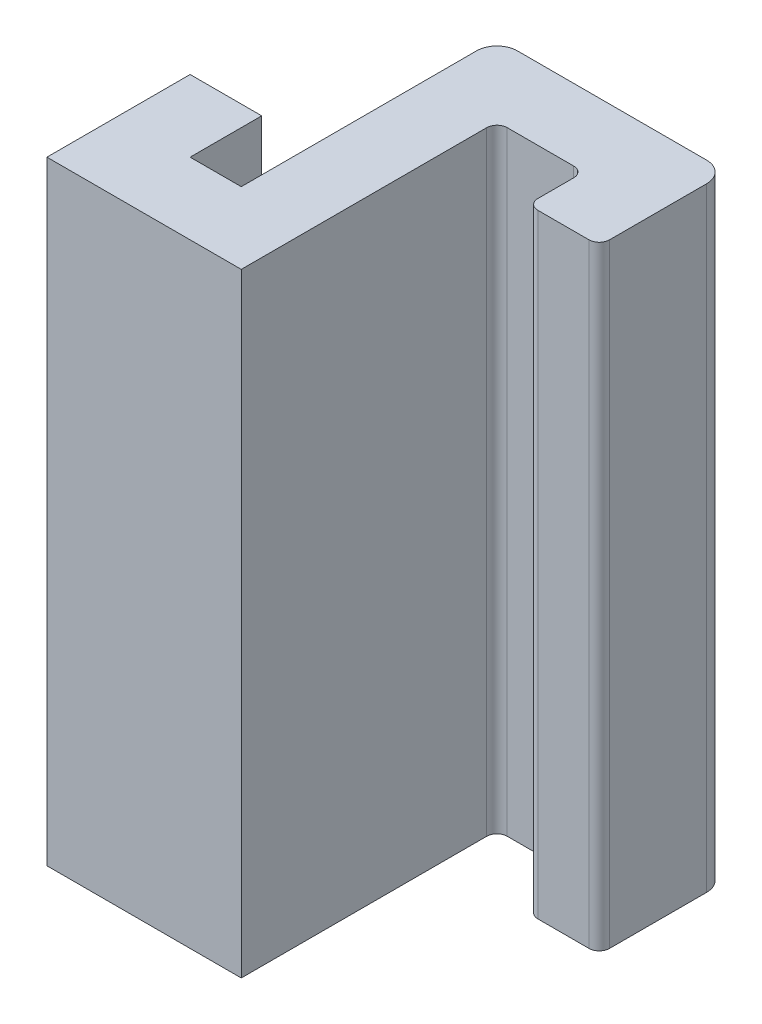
ISO-10303-21;
HEADER;
FILE_DESCRIPTION(('STEP AP214'),'2;1');
FILE_NAME('part.step','',(''),(''),'','','');
FILE_SCHEMA(('AUTOMOTIVE_DESIGN { 1 0 10303 214 1 1 1 1 }'));
ENDSEC;
DATA;
#1=APPLICATION_CONTEXT('core data for automotive mechanical design processes');
#2=APPLICATION_PROTOCOL_DEFINITION('international standard','automotive_design',2000,#1);
#3=PRODUCT_CONTEXT('',#1,'mechanical');
#4=PRODUCT('Part','Part','',(#3));
#5=PRODUCT_RELATED_PRODUCT_CATEGORY('part','',(#4));
#6=PRODUCT_DEFINITION_FORMATION('','',#4);
#7=PRODUCT_DEFINITION_CONTEXT('part definition',#1,'design');
#8=PRODUCT_DEFINITION('design','',#6,#7);
#9=PRODUCT_DEFINITION_SHAPE('','',#8);
#10=(LENGTH_UNIT() NAMED_UNIT(*) SI_UNIT(.MILLI.,.METRE.));
#11=(NAMED_UNIT(*) PLANE_ANGLE_UNIT() SI_UNIT($,.RADIAN.));
#12=(NAMED_UNIT(*) SI_UNIT($,.STERADIAN.) SOLID_ANGLE_UNIT());
#13=UNCERTAINTY_MEASURE_WITH_UNIT(LENGTH_MEASURE(1.E-05),#10,'distance_accuracy_value','');
#14=(GEOMETRIC_REPRESENTATION_CONTEXT(3) GLOBAL_UNCERTAINTY_ASSIGNED_CONTEXT((#13)) GLOBAL_UNIT_ASSIGNED_CONTEXT((#10,
#11,#12)) REPRESENTATION_CONTEXT('',''));
#15=CARTESIAN_POINT('',(0.,0.,0.));
#16=DIRECTION('',(0.,0.,1.));
#17=DIRECTION('',(1.,0.,0.));
#18=AXIS2_PLACEMENT_3D('',#15,#16,#17);
#19=CARTESIAN_POINT('',(0.,60.,0.));
#20=DIRECTION('',(-1.,0.,0.));
#21=DIRECTION('',(0.,0.,1.));
#22=AXIS2_PLACEMENT_3D('',#19,#20,#21);
#23=PLANE('',#22);
#24=DIRECTION('',(0.,0.,-1.));
#25=VECTOR('',#24,1.);
#26=CARTESIAN_POINT('',(0.,0.,0.));
#27=LINE('',#26,#25);
#28=CARTESIAN_POINT('',(0.,0.,0.));
#29=VERTEX_POINT('',#28);
#30=CARTESIAN_POINT('',(0.,0.,-24.));
#31=VERTEX_POINT('',#30);
#32=EDGE_CURVE('E195',#29,#31,#27,.T.);
#33=ORIENTED_EDGE('',*,*,#32,.T.);
#34=DIRECTION('',(0.,-1.,0.));
#35=VECTOR('',#34,1.);
#36=CARTESIAN_POINT('',(0.,60.,-24.));
#37=LINE('',#36,#35);
#38=CARTESIAN_POINT('',(0.,60.,-24.));
#39=VERTEX_POINT('',#38);
#40=EDGE_CURVE('E240',#31,#39,#37,.F.);
#41=ORIENTED_EDGE('',*,*,#40,.T.);
#42=DIRECTION('',(0.,0.,-1.));
#43=VECTOR('',#42,1.);
#44=CARTESIAN_POINT('',(0.,60.,0.));
#45=LINE('',#44,#43);
#46=CARTESIAN_POINT('',(0.,60.,0.));
#47=VERTEX_POINT('',#46);
#48=EDGE_CURVE('E223',#47,#39,#45,.T.);
#49=ORIENTED_EDGE('',*,*,#48,.F.);
#50=DIRECTION('',(0.,-1.,0.));
#51=VECTOR('',#50,1.);
#52=CARTESIAN_POINT('',(0.,60.,0.));
#53=LINE('',#52,#51);
#54=EDGE_CURVE('E194',#47,#29,#53,.T.);
#55=ORIENTED_EDGE('',*,*,#54,.T.);
#56=EDGE_LOOP('',(#33,#41,#49,#55));
#57=FACE_BOUND('',#56,.T.);
#58=ADVANCED_FACE('F35',(#57),#23,.F.);
#59=CARTESIAN_POINT('',(0.,60.,-25.));
#60=DIRECTION('',(0.,0.,-1.));
#61=DIRECTION('',(-1.,0.,0.));
#62=AXIS2_PLACEMENT_3D('',#59,#60,#61);
#63=PLANE('',#62);
#64=DIRECTION('',(1.,0.,0.));
#65=VECTOR('',#64,1.);
#66=CARTESIAN_POINT('',(0.,60.,-25.));
#67=LINE('',#66,#65);
#68=CARTESIAN_POINT('',(1.,60.,-25.));
#69=VERTEX_POINT('',#68);
#70=CARTESIAN_POINT('',(7.5,60.,-25.));
#71=VERTEX_POINT('',#70);
#72=EDGE_CURVE('E309',#69,#71,#67,.T.);
#73=ORIENTED_EDGE('',*,*,#72,.F.);
#74=DIRECTION('',(0.,-1.,0.));
#75=VECTOR('',#74,1.);
#76=CARTESIAN_POINT('',(1.,0.,-25.));
#77=LINE('',#76,#75);
#78=CARTESIAN_POINT('',(1.,0.,-25.));
#79=VERTEX_POINT('',#78);
#80=EDGE_CURVE('E237',#69,#79,#77,.T.);
#81=ORIENTED_EDGE('',*,*,#80,.T.);
#82=DIRECTION('',(1.,0.,0.));
#83=VECTOR('',#82,1.);
#84=CARTESIAN_POINT('',(0.,0.,-25.));
#85=LINE('',#84,#83);
#86=CARTESIAN_POINT('',(7.5,0.,-25.));
#87=VERTEX_POINT('',#86);
#88=EDGE_CURVE('E198',#79,#87,#85,.T.);
#89=ORIENTED_EDGE('',*,*,#88,.T.);
#90=DIRECTION('',(0.,-1.,0.));
#91=VECTOR('',#90,1.);
#92=CARTESIAN_POINT('',(7.5,60.,-25.));
#93=LINE('',#92,#91);
#94=EDGE_CURVE('E177',#87,#71,#93,.F.);
#95=ORIENTED_EDGE('',*,*,#94,.T.);
#96=EDGE_LOOP('',(#73,#81,#89,#95));
#97=FACE_BOUND('',#96,.T.);
#98=ADVANCED_FACE('F317',(#97),#63,.F.);
#99=CARTESIAN_POINT('',(8.5,60.,-25.));
#100=DIRECTION('',(1.,0.,0.));
#101=DIRECTION('',(0.,0.,-1.));
#102=AXIS2_PLACEMENT_3D('',#99,#100,#101);
#103=PLANE('',#102);
#104=DIRECTION('',(0.,0.,1.));
#105=VECTOR('',#104,1.);
#106=CARTESIAN_POINT('',(8.5,60.,-25.));
#107=LINE('',#106,#105);
#108=CARTESIAN_POINT('',(8.5,60.,-24.));
#109=VERTEX_POINT('',#108);
#110=CARTESIAN_POINT('',(8.5,60.,-20.5));
#111=VERTEX_POINT('',#110);
#112=EDGE_CURVE('E330',#109,#111,#107,.T.);
#113=ORIENTED_EDGE('',*,*,#112,.F.);
#114=DIRECTION('',(0.,-1.,0.));
#115=VECTOR('',#114,1.);
#116=CARTESIAN_POINT('',(8.5,0.,-24.));
#117=LINE('',#116,#115);
#118=CARTESIAN_POINT('',(8.5,0.,-24.));
#119=VERTEX_POINT('',#118);
#120=EDGE_CURVE('E244',#109,#119,#117,.T.);
#121=ORIENTED_EDGE('',*,*,#120,.T.);
#122=DIRECTION('',(0.,0.,1.));
#123=VECTOR('',#122,1.);
#124=CARTESIAN_POINT('',(8.5,0.,-25.));
#125=LINE('',#124,#123);
#126=CARTESIAN_POINT('',(8.5,0.,-20.5));
#127=VERTEX_POINT('',#126);
#128=EDGE_CURVE('E201',#119,#127,#125,.T.);
#129=ORIENTED_EDGE('',*,*,#128,.T.);
#130=DIRECTION('',(0.,-1.,0.));
#131=VECTOR('',#130,1.);
#132=CARTESIAN_POINT('',(8.5,60.,-20.5));
#133=LINE('',#132,#131);
#134=EDGE_CURVE('E242',#127,#111,#133,.F.);
#135=ORIENTED_EDGE('',*,*,#134,.T.);
#136=EDGE_LOOP('',(#113,#121,#129,#135));
#137=FACE_BOUND('',#136,.T.);
#138=ADVANCED_FACE('F327',(#137),#103,.F.);
#139=CARTESIAN_POINT('',(15.5,60.,-19.5));
#140=DIRECTION('',(0.,0.,-1.));
#141=DIRECTION('',(-1.,0.,0.));
#142=AXIS2_PLACEMENT_3D('',#139,#140,#141);
#143=PLANE('',#142);
#144=DIRECTION('',(1.,0.,0.));
#145=VECTOR('',#144,1.);
#146=CARTESIAN_POINT('',(15.5,0.,-19.5));
#147=LINE('',#146,#145);
#148=CARTESIAN_POINT('',(9.5,0.,-19.5));
#149=VERTEX_POINT('',#148);
#150=CARTESIAN_POINT('',(14.5,0.,-19.5));
#151=VERTEX_POINT('',#150);
#152=EDGE_CURVE('E204',#149,#151,#147,.T.);
#153=ORIENTED_EDGE('',*,*,#152,.T.);
#154=DIRECTION('',(0.,-1.,0.));
#155=VECTOR('',#154,1.);
#156=CARTESIAN_POINT('',(14.5,60.,-19.5));
#157=LINE('',#156,#155);
#158=CARTESIAN_POINT('',(14.5,60.,-19.5));
#159=VERTEX_POINT('',#158);
#160=EDGE_CURVE('E257',#151,#159,#157,.F.);
#161=ORIENTED_EDGE('',*,*,#160,.T.);
#162=DIRECTION('',(1.,0.,0.));
#163=VECTOR('',#162,1.);
#164=CARTESIAN_POINT('',(15.5,60.,-19.5));
#165=LINE('',#164,#163);
#166=CARTESIAN_POINT('',(9.5,60.,-19.5));
#167=VERTEX_POINT('',#166);
#168=EDGE_CURVE('E332',#167,#159,#165,.T.);
#169=ORIENTED_EDGE('',*,*,#168,.F.);
#170=DIRECTION('',(0.,-1.,0.));
#171=VECTOR('',#170,1.);
#172=CARTESIAN_POINT('',(9.5,60.,-19.5));
#173=LINE('',#172,#171);
#174=EDGE_CURVE('E254',#167,#149,#173,.T.);
#175=ORIENTED_EDGE('',*,*,#174,.T.);
#176=EDGE_LOOP('',(#153,#161,#169,#175));
#177=FACE_BOUND('',#176,.T.);
#178=ADVANCED_FACE('F373',(#177),#143,.F.);
#179=CARTESIAN_POINT('',(15.5,60.,-32.));
#180=DIRECTION('',(-1.,0.,0.));
#181=DIRECTION('',(0.,0.,1.));
#182=AXIS2_PLACEMENT_3D('',#179,#180,#181);
#183=PLANE('',#182);
#184=DIRECTION('',(0.,0.,-1.));
#185=VECTOR('',#184,1.);
#186=CARTESIAN_POINT('',(15.5,0.,-32.));
#187=LINE('',#186,#185);
#188=CARTESIAN_POINT('',(15.5,0.,-20.5));
#189=VERTEX_POINT('',#188);
#190=CARTESIAN_POINT('',(15.5,0.,-30.));
#191=VERTEX_POINT('',#190);
#192=EDGE_CURVE('E207',#189,#191,#187,.T.);
#193=ORIENTED_EDGE('',*,*,#192,.T.);
#194=DIRECTION('',(0.,-1.,0.));
#195=VECTOR('',#194,1.);
#196=CARTESIAN_POINT('',(15.5,60.,-30.));
#197=LINE('',#196,#195);
#198=CARTESIAN_POINT('',(15.5,60.,-30.));
#199=VERTEX_POINT('',#198);
#200=EDGE_CURVE('E276',#191,#199,#197,.F.);
#201=ORIENTED_EDGE('',*,*,#200,.T.);
#202=DIRECTION('',(0.,0.,-1.));
#203=VECTOR('',#202,1.);
#204=CARTESIAN_POINT('',(15.5,60.,-32.));
#205=LINE('',#204,#203);
#206=CARTESIAN_POINT('',(15.5,60.,-20.5));
#207=VERTEX_POINT('',#206);
#208=EDGE_CURVE('E335',#207,#199,#205,.T.);
#209=ORIENTED_EDGE('',*,*,#208,.F.);
#210=DIRECTION('',(0.,-1.,0.));
#211=VECTOR('',#210,1.);
#212=CARTESIAN_POINT('',(15.5,60.,-20.5));
#213=LINE('',#212,#211);
#214=EDGE_CURVE('E247',#207,#189,#213,.T.);
#215=ORIENTED_EDGE('',*,*,#214,.T.);
#216=EDGE_LOOP('',(#193,#201,#209,#215));
#217=FACE_BOUND('',#216,.T.);
#218=ADVANCED_FACE('F379',(#217),#183,.F.);
#219=CARTESIAN_POINT('',(-7.,60.,-32.));
#220=DIRECTION('',(0.,0.,1.));
#221=DIRECTION('',(1.,0.,0.));
#222=AXIS2_PLACEMENT_3D('',#219,#220,#221);
#223=PLANE('',#222);
#224=DIRECTION('',(-1.,0.,0.));
#225=VECTOR('',#224,1.);
#226=CARTESIAN_POINT('',(-7.,0.,-32.));
#227=LINE('',#226,#225);
#228=CARTESIAN_POINT('',(13.5,0.,-32.));
#229=VERTEX_POINT('',#228);
#230=CARTESIAN_POINT('',(-5.,0.,-32.));
#231=VERTEX_POINT('',#230);
#232=EDGE_CURVE('E210',#229,#231,#227,.T.);
#233=ORIENTED_EDGE('',*,*,#232,.T.);
#234=DIRECTION('',(0.,-1.,0.));
#235=VECTOR('',#234,1.);
#236=CARTESIAN_POINT('',(-5.,60.,-32.));
#237=LINE('',#236,#235);
#238=CARTESIAN_POINT('',(-5.,60.,-32.));
#239=VERTEX_POINT('',#238);
#240=EDGE_CURVE('E43',#231,#239,#237,.F.);
#241=ORIENTED_EDGE('',*,*,#240,.T.);
#242=DIRECTION('',(-1.,0.,0.));
#243=VECTOR('',#242,1.);
#244=CARTESIAN_POINT('',(-7.,60.,-32.));
#245=LINE('',#244,#243);
#246=CARTESIAN_POINT('',(13.5,60.,-32.));
#247=VERTEX_POINT('',#246);
#248=EDGE_CURVE('E169',#247,#239,#245,.T.);
#249=ORIENTED_EDGE('',*,*,#248,.F.);
#250=DIRECTION('',(0.,-1.,0.));
#251=VECTOR('',#250,1.);
#252=CARTESIAN_POINT('',(13.5,60.,-32.));
#253=LINE('',#252,#251);
#254=EDGE_CURVE('E271',#247,#229,#253,.T.);
#255=ORIENTED_EDGE('',*,*,#254,.T.);
#256=EDGE_LOOP('',(#233,#241,#249,#255));
#257=FACE_BOUND('',#256,.T.);
#258=ADVANCED_FACE('F382',(#257),#223,.F.);
#259=CARTESIAN_POINT('',(-7.,60.,-7.));
#260=DIRECTION('',(1.,0.,0.));
#261=DIRECTION('',(0.,0.,-1.));
#262=AXIS2_PLACEMENT_3D('',#259,#260,#261);
#263=PLANE('',#262);
#264=DIRECTION('',(0.,0.,1.));
#265=VECTOR('',#264,1.);
#266=CARTESIAN_POINT('',(-7.,60.,-7.));
#267=LINE('',#266,#265);
#268=CARTESIAN_POINT('',(-7.,60.,-30.));
#269=VERTEX_POINT('',#268);
#270=CARTESIAN_POINT('',(-7.,60.,-7.));
#271=VERTEX_POINT('',#270);
#272=EDGE_CURVE('E159',#269,#271,#267,.T.);
#273=ORIENTED_EDGE('',*,*,#272,.F.);
#274=DIRECTION('',(0.,-1.,0.));
#275=VECTOR('',#274,1.);
#276=CARTESIAN_POINT('',(-7.,60.,-30.));
#277=LINE('',#276,#275);
#278=CARTESIAN_POINT('',(-7.,0.,-30.));
#279=VERTEX_POINT('',#278);
#280=EDGE_CURVE('E280',#269,#279,#277,.T.);
#281=ORIENTED_EDGE('',*,*,#280,.T.);
#282=DIRECTION('',(0.,0.,1.));
#283=VECTOR('',#282,1.);
#284=CARTESIAN_POINT('',(-7.,0.,-7.));
#285=LINE('',#284,#283);
#286=CARTESIAN_POINT('',(-7.,0.,-7.));
#287=VERTEX_POINT('',#286);
#288=EDGE_CURVE('E174',#279,#287,#285,.T.);
#289=ORIENTED_EDGE('',*,*,#288,.T.);
#290=DIRECTION('',(0.,-1.,0.));
#291=VECTOR('',#290,1.);
#292=CARTESIAN_POINT('',(-7.,60.,-7.));
#293=LINE('',#292,#291);
#294=EDGE_CURVE('E172',#271,#287,#293,.T.);
#295=ORIENTED_EDGE('',*,*,#294,.F.);
#296=EDGE_LOOP('',(#273,#281,#289,#295));
#297=FACE_BOUND('',#296,.T.);
#298=ADVANCED_FACE('F173',(#297),#263,.F.);
#299=CARTESIAN_POINT('',(-12.,60.,-7.));
#300=DIRECTION('',(0.,0.,1.));
#301=DIRECTION('',(1.,0.,0.));
#302=AXIS2_PLACEMENT_3D('',#299,#300,#301);
#303=PLANE('',#302);
#304=DIRECTION('',(-1.,0.,0.));
#305=VECTOR('',#304,1.);
#306=CARTESIAN_POINT('',(-12.,0.,-7.));
#307=LINE('',#306,#305);
#308=CARTESIAN_POINT('',(-12.,0.,-7.));
#309=VERTEX_POINT('',#308);
#310=EDGE_CURVE('E213',#287,#309,#307,.T.);
#311=ORIENTED_EDGE('',*,*,#310,.T.);
#312=DIRECTION('',(0.,-1.,0.));
#313=VECTOR('',#312,1.);
#314=CARTESIAN_POINT('',(-12.,60.,-7.));
#315=LINE('',#314,#313);
#316=CARTESIAN_POINT('',(-12.,60.,-7.));
#317=VERTEX_POINT('',#316);
#318=EDGE_CURVE('E178',#317,#309,#315,.T.);
#319=ORIENTED_EDGE('',*,*,#318,.F.);
#320=DIRECTION('',(-1.,0.,0.));
#321=VECTOR('',#320,1.);
#322=CARTESIAN_POINT('',(-12.,60.,-7.));
#323=LINE('',#322,#321);
#324=EDGE_CURVE('E163',#271,#317,#323,.T.);
#325=ORIENTED_EDGE('',*,*,#324,.F.);
#326=ORIENTED_EDGE('',*,*,#294,.T.);
#327=EDGE_LOOP('',(#311,#319,#325,#326));
#328=FACE_BOUND('',#327,.T.);
#329=ADVANCED_FACE('F180',(#328),#303,.F.);
#330=CARTESIAN_POINT('',(-12.,60.,-14.));
#331=DIRECTION('',(-1.,0.,0.));
#332=DIRECTION('',(0.,0.,1.));
#333=AXIS2_PLACEMENT_3D('',#330,#331,#332);
#334=PLANE('',#333);
#335=DIRECTION('',(0.,0.,-1.));
#336=VECTOR('',#335,1.);
#337=CARTESIAN_POINT('',(-12.,0.,-14.));
#338=LINE('',#337,#336);
#339=CARTESIAN_POINT('',(-12.,0.,-14.));
#340=VERTEX_POINT('',#339);
#341=EDGE_CURVE('E215',#309,#340,#338,.T.);
#342=ORIENTED_EDGE('',*,*,#341,.T.);
#343=DIRECTION('',(0.,-1.,0.));
#344=VECTOR('',#343,1.);
#345=CARTESIAN_POINT('',(-12.,60.,-14.));
#346=LINE('',#345,#344);
#347=CARTESIAN_POINT('',(-12.,60.,-14.));
#348=VERTEX_POINT('',#347);
#349=EDGE_CURVE('E232',#348,#340,#346,.T.);
#350=ORIENTED_EDGE('',*,*,#349,.F.);
#351=DIRECTION('',(0.,0.,-1.));
#352=VECTOR('',#351,1.);
#353=CARTESIAN_POINT('',(-12.,60.,-14.));
#354=LINE('',#353,#352);
#355=EDGE_CURVE('E183',#317,#348,#354,.T.);
#356=ORIENTED_EDGE('',*,*,#355,.F.);
#357=ORIENTED_EDGE('',*,*,#318,.T.);
#358=EDGE_LOOP('',(#342,#350,#356,#357));
#359=FACE_BOUND('',#358,.T.);
#360=ADVANCED_FACE('F287',(#359),#334,.F.);
#361=CARTESIAN_POINT('',(-19.,60.,-14.));
#362=DIRECTION('',(0.,0.,1.));
#363=DIRECTION('',(1.,0.,0.));
#364=AXIS2_PLACEMENT_3D('',#361,#362,#363);
#365=PLANE('',#364);
#366=DIRECTION('',(-1.,0.,0.));
#367=VECTOR('',#366,1.);
#368=CARTESIAN_POINT('',(-19.,0.,-14.));
#369=LINE('',#368,#367);
#370=CARTESIAN_POINT('',(-19.,0.,-14.));
#371=VERTEX_POINT('',#370);
#372=EDGE_CURVE('E217',#340,#371,#369,.T.);
#373=ORIENTED_EDGE('',*,*,#372,.T.);
#374=DIRECTION('',(0.,-1.,0.));
#375=VECTOR('',#374,1.);
#376=CARTESIAN_POINT('',(-19.,60.,-14.));
#377=LINE('',#376,#375);
#378=CARTESIAN_POINT('',(-19.,60.,-14.));
#379=VERTEX_POINT('',#378);
#380=EDGE_CURVE('E229',#379,#371,#377,.T.);
#381=ORIENTED_EDGE('',*,*,#380,.F.);
#382=DIRECTION('',(-1.,0.,0.));
#383=VECTOR('',#382,1.);
#384=CARTESIAN_POINT('',(-19.,60.,-14.));
#385=LINE('',#384,#383);
#386=EDGE_CURVE('E185',#348,#379,#385,.T.);
#387=ORIENTED_EDGE('',*,*,#386,.F.);
#388=ORIENTED_EDGE('',*,*,#349,.T.);
#389=EDGE_LOOP('',(#373,#381,#387,#388));
#390=FACE_BOUND('',#389,.T.);
#391=ADVANCED_FACE('F294',(#390),#365,.F.);
#392=CARTESIAN_POINT('',(-19.,60.,0.));
#393=DIRECTION('',(1.,0.,0.));
#394=DIRECTION('',(0.,0.,-1.));
#395=AXIS2_PLACEMENT_3D('',#392,#393,#394);
#396=PLANE('',#395);
#397=DIRECTION('',(0.,0.,1.));
#398=VECTOR('',#397,1.);
#399=CARTESIAN_POINT('',(-19.,0.,0.));
#400=LINE('',#399,#398);
#401=CARTESIAN_POINT('',(-19.,0.,0.));
#402=VERTEX_POINT('',#401);
#403=EDGE_CURVE('E219',#371,#402,#400,.T.);
#404=ORIENTED_EDGE('',*,*,#403,.T.);
#405=DIRECTION('',(0.,-1.,0.));
#406=VECTOR('',#405,1.);
#407=CARTESIAN_POINT('',(-19.,60.,0.));
#408=LINE('',#407,#406);
#409=CARTESIAN_POINT('',(-19.,60.,0.));
#410=VERTEX_POINT('',#409);
#411=EDGE_CURVE('E226',#410,#402,#408,.T.);
#412=ORIENTED_EDGE('',*,*,#411,.F.);
#413=DIRECTION('',(0.,0.,1.));
#414=VECTOR('',#413,1.);
#415=CARTESIAN_POINT('',(-19.,60.,0.));
#416=LINE('',#415,#414);
#417=EDGE_CURVE('E190',#379,#410,#416,.T.);
#418=ORIENTED_EDGE('',*,*,#417,.F.);
#419=ORIENTED_EDGE('',*,*,#380,.T.);
#420=EDGE_LOOP('',(#404,#412,#418,#419));
#421=FACE_BOUND('',#420,.T.);
#422=ADVANCED_FACE('F297',(#421),#396,.F.);
#423=CARTESIAN_POINT('',(0.,60.,0.));
#424=DIRECTION('',(0.,0.,-1.));
#425=DIRECTION('',(-1.,0.,0.));
#426=AXIS2_PLACEMENT_3D('',#423,#424,#425);
#427=PLANE('',#426);
#428=DIRECTION('',(1.,0.,0.));
#429=VECTOR('',#428,1.);
#430=CARTESIAN_POINT('',(0.,0.,0.));
#431=LINE('',#430,#429);
#432=EDGE_CURVE('E221',#402,#29,#431,.T.);
#433=ORIENTED_EDGE('',*,*,#432,.T.);
#434=ORIENTED_EDGE('',*,*,#54,.F.);
#435=DIRECTION('',(1.,0.,0.));
#436=VECTOR('',#435,1.);
#437=CARTESIAN_POINT('',(0.,60.,0.));
#438=LINE('',#437,#436);
#439=EDGE_CURVE('E192',#410,#47,#438,.T.);
#440=ORIENTED_EDGE('',*,*,#439,.F.);
#441=ORIENTED_EDGE('',*,*,#411,.T.);
#442=EDGE_LOOP('',(#433,#434,#440,#441));
#443=FACE_BOUND('',#442,.T.);
#444=ADVANCED_FACE('F302',(#443),#427,.F.);
#445=CARTESIAN_POINT('',(0.,60.,0.));
#446=DIRECTION('',(0.,-1.,0.));
#447=DIRECTION('',(0.,0.,-1.));
#448=AXIS2_PLACEMENT_3D('',#445,#446,#447);
#449=PLANE('',#448);
#450=ORIENTED_EDGE('',*,*,#248,.T.);
#451=CARTESIAN_POINT('',(-5.,60.,-30.));
#452=DIRECTION('',(0.,-1.,0.));
#453=DIRECTION('',(0.,0.,-1.));
#454=AXIS2_PLACEMENT_3D('',#451,#452,#453);
#455=CIRCLE('',#454,2.);
#456=EDGE_CURVE('E11',#239,#269,#455,.F.);
#457=ORIENTED_EDGE('',*,*,#456,.T.);
#458=ORIENTED_EDGE('',*,*,#272,.T.);
#459=ORIENTED_EDGE('',*,*,#324,.T.);
#460=ORIENTED_EDGE('',*,*,#355,.T.);
#461=ORIENTED_EDGE('',*,*,#386,.T.);
#462=ORIENTED_EDGE('',*,*,#417,.T.);
#463=ORIENTED_EDGE('',*,*,#439,.T.);
#464=ORIENTED_EDGE('',*,*,#48,.T.);
#465=CARTESIAN_POINT('',(1.,60.,-24.));
#466=DIRECTION('',(0.,-1.,0.));
#467=DIRECTION('',(0.,0.,-1.));
#468=AXIS2_PLACEMENT_3D('',#465,#466,#467);
#469=CIRCLE('',#468,1.);
#470=EDGE_CURVE('E265',#39,#69,#469,.T.);
#471=ORIENTED_EDGE('',*,*,#470,.T.);
#472=ORIENTED_EDGE('',*,*,#72,.T.);
#473=CARTESIAN_POINT('',(7.5,60.,-24.));
#474=DIRECTION('',(0.,-1.,0.));
#475=DIRECTION('',(0.,0.,-1.));
#476=AXIS2_PLACEMENT_3D('',#473,#474,#475);
#477=CIRCLE('',#476,1.);
#478=EDGE_CURVE('E269',#71,#109,#477,.T.);
#479=ORIENTED_EDGE('',*,*,#478,.T.);
#480=ORIENTED_EDGE('',*,*,#112,.T.);
#481=CARTESIAN_POINT('',(9.5,60.,-20.5));
#482=DIRECTION('',(0.,-1.,0.));
#483=DIRECTION('',(0.,0.,-1.));
#484=AXIS2_PLACEMENT_3D('',#481,#482,#483);
#485=CIRCLE('',#484,1.);
#486=EDGE_CURVE('E259',#111,#167,#485,.F.);
#487=ORIENTED_EDGE('',*,*,#486,.T.);
#488=ORIENTED_EDGE('',*,*,#168,.T.);
#489=CARTESIAN_POINT('',(14.5,60.,-20.5));
#490=DIRECTION('',(0.,-1.,0.));
#491=DIRECTION('',(0.,0.,-1.));
#492=AXIS2_PLACEMENT_3D('',#489,#490,#491);
#493=CIRCLE('',#492,1.);
#494=EDGE_CURVE('E261',#159,#207,#493,.F.);
#495=ORIENTED_EDGE('',*,*,#494,.T.);
#496=ORIENTED_EDGE('',*,*,#208,.T.);
#497=CARTESIAN_POINT('',(13.5,60.,-30.));
#498=DIRECTION('',(0.,-1.,0.));
#499=DIRECTION('',(0.,0.,-1.));
#500=AXIS2_PLACEMENT_3D('',#497,#498,#499);
#501=CIRCLE('',#500,2.);
#502=EDGE_CURVE('E278',#199,#247,#501,.F.);
#503=ORIENTED_EDGE('',*,*,#502,.T.);
#504=EDGE_LOOP('',(#450,#457,#458,#459,#460,#461,#462,#463,#464,#471,#472,#479,#480,#487,#488,
#495,#496,#503));
#505=FACE_BOUND('',#504,.T.);
#506=ADVANCED_FACE('F161',(#505),#449,.F.);
#507=CARTESIAN_POINT('',(0.,0.,0.));
#508=DIRECTION('',(0.,-1.,0.));
#509=DIRECTION('',(0.,0.,-1.));
#510=AXIS2_PLACEMENT_3D('',#507,#508,#509);
#511=PLANE('',#510);
#512=ORIENTED_EDGE('',*,*,#288,.F.);
#513=CARTESIAN_POINT('',(-5.,0.,-30.));
#514=DIRECTION('',(0.,-1.,0.));
#515=DIRECTION('',(0.,0.,-1.));
#516=AXIS2_PLACEMENT_3D('',#513,#514,#515);
#517=CIRCLE('',#516,2.);
#518=EDGE_CURVE('E57',#279,#231,#517,.T.);
#519=ORIENTED_EDGE('',*,*,#518,.T.);
#520=ORIENTED_EDGE('',*,*,#232,.F.);
#521=CARTESIAN_POINT('',(13.5,0.,-30.));
#522=DIRECTION('',(0.,-1.,0.));
#523=DIRECTION('',(0.,0.,-1.));
#524=AXIS2_PLACEMENT_3D('',#521,#522,#523);
#525=CIRCLE('',#524,2.);
#526=EDGE_CURVE('E274',#229,#191,#525,.T.);
#527=ORIENTED_EDGE('',*,*,#526,.T.);
#528=ORIENTED_EDGE('',*,*,#192,.F.);
#529=CARTESIAN_POINT('',(14.5,0.,-20.5));
#530=DIRECTION('',(0.,-1.,0.));
#531=DIRECTION('',(0.,0.,-1.));
#532=AXIS2_PLACEMENT_3D('',#529,#530,#531);
#533=CIRCLE('',#532,1.);
#534=EDGE_CURVE('E252',#189,#151,#533,.T.);
#535=ORIENTED_EDGE('',*,*,#534,.T.);
#536=ORIENTED_EDGE('',*,*,#152,.F.);
#537=CARTESIAN_POINT('',(9.5,0.,-20.5));
#538=DIRECTION('',(0.,-1.,0.));
#539=DIRECTION('',(0.,0.,-1.));
#540=AXIS2_PLACEMENT_3D('',#537,#538,#539);
#541=CIRCLE('',#540,1.);
#542=EDGE_CURVE('E250',#149,#127,#541,.T.);
#543=ORIENTED_EDGE('',*,*,#542,.T.);
#544=ORIENTED_EDGE('',*,*,#128,.F.);
#545=CARTESIAN_POINT('',(7.5,0.,-24.));
#546=DIRECTION('',(0.,-1.,0.));
#547=DIRECTION('',(0.,0.,-1.));
#548=AXIS2_PLACEMENT_3D('',#545,#546,#547);
#549=CIRCLE('',#548,1.);
#550=EDGE_CURVE('E267',#119,#87,#549,.F.);
#551=ORIENTED_EDGE('',*,*,#550,.T.);
#552=ORIENTED_EDGE('',*,*,#88,.F.);
#553=CARTESIAN_POINT('',(1.,0.,-24.));
#554=DIRECTION('',(0.,-1.,0.));
#555=DIRECTION('',(0.,0.,-1.));
#556=AXIS2_PLACEMENT_3D('',#553,#554,#555);
#557=CIRCLE('',#556,1.);
#558=EDGE_CURVE('E263',#79,#31,#557,.F.);
#559=ORIENTED_EDGE('',*,*,#558,.T.);
#560=ORIENTED_EDGE('',*,*,#32,.F.);
#561=ORIENTED_EDGE('',*,*,#432,.F.);
#562=ORIENTED_EDGE('',*,*,#403,.F.);
#563=ORIENTED_EDGE('',*,*,#372,.F.);
#564=ORIENTED_EDGE('',*,*,#341,.F.);
#565=ORIENTED_EDGE('',*,*,#310,.F.);
#566=EDGE_LOOP('',(#512,#519,#520,#527,#528,#535,#536,#543,#544,#551,#552,#559,#560,#561,#562,
#563,#564,#565));
#567=FACE_BOUND('',#566,.T.);
#568=ADVANCED_FACE('F283',(#567),#511,.T.);
#569=CARTESIAN_POINT('',(1.,60.,-24.));
#570=DIRECTION('',(0.,1.,0.));
#571=DIRECTION('',(0.,0.,1.));
#572=AXIS2_PLACEMENT_3D('',#569,#570,#571);
#573=CYLINDRICAL_SURFACE('',#572,1.);
#574=ORIENTED_EDGE('',*,*,#470,.F.);
#575=ORIENTED_EDGE('',*,*,#40,.F.);
#576=ORIENTED_EDGE('',*,*,#558,.F.);
#577=ORIENTED_EDGE('',*,*,#80,.F.);
#578=EDGE_LOOP('',(#574,#575,#576,#577));
#579=FACE_BOUND('',#578,.T.);
#580=ADVANCED_FACE('F314',(#579),#573,.F.);
#581=CARTESIAN_POINT('',(7.5,60.,-24.));
#582=DIRECTION('',(0.,1.,0.));
#583=DIRECTION('',(0.,0.,1.));
#584=AXIS2_PLACEMENT_3D('',#581,#582,#583);
#585=CYLINDRICAL_SURFACE('',#584,1.);
#586=ORIENTED_EDGE('',*,*,#478,.F.);
#587=ORIENTED_EDGE('',*,*,#94,.F.);
#588=ORIENTED_EDGE('',*,*,#550,.F.);
#589=ORIENTED_EDGE('',*,*,#120,.F.);
#590=EDGE_LOOP('',(#586,#587,#588,#589));
#591=FACE_BOUND('',#590,.T.);
#592=ADVANCED_FACE('F324',(#591),#585,.F.);
#593=CARTESIAN_POINT('',(14.5,60.,-20.5));
#594=DIRECTION('',(0.,-1.,0.));
#595=DIRECTION('',(0.,0.,-1.));
#596=AXIS2_PLACEMENT_3D('',#593,#594,#595);
#597=CYLINDRICAL_SURFACE('',#596,1.);
#598=ORIENTED_EDGE('',*,*,#494,.F.);
#599=ORIENTED_EDGE('',*,*,#160,.F.);
#600=ORIENTED_EDGE('',*,*,#534,.F.);
#601=ORIENTED_EDGE('',*,*,#214,.F.);
#602=EDGE_LOOP('',(#598,#599,#600,#601));
#603=FACE_BOUND('',#602,.T.);
#604=ADVANCED_FACE('F361',(#603),#597,.T.);
#605=CARTESIAN_POINT('',(9.5,60.,-20.5));
#606=DIRECTION('',(0.,-1.,0.));
#607=DIRECTION('',(0.,0.,-1.));
#608=AXIS2_PLACEMENT_3D('',#605,#606,#607);
#609=CYLINDRICAL_SURFACE('',#608,1.);
#610=ORIENTED_EDGE('',*,*,#486,.F.);
#611=ORIENTED_EDGE('',*,*,#134,.F.);
#612=ORIENTED_EDGE('',*,*,#542,.F.);
#613=ORIENTED_EDGE('',*,*,#174,.F.);
#614=EDGE_LOOP('',(#610,#611,#612,#613));
#615=FACE_BOUND('',#614,.T.);
#616=ADVANCED_FACE('F347',(#615),#609,.T.);
#617=CARTESIAN_POINT('',(13.5,60.,-30.));
#618=DIRECTION('',(0.,-1.,0.));
#619=DIRECTION('',(0.,0.,-1.));
#620=AXIS2_PLACEMENT_3D('',#617,#618,#619);
#621=CYLINDRICAL_SURFACE('',#620,2.);
#622=ORIENTED_EDGE('',*,*,#502,.F.);
#623=ORIENTED_EDGE('',*,*,#200,.F.);
#624=ORIENTED_EDGE('',*,*,#526,.F.);
#625=ORIENTED_EDGE('',*,*,#254,.F.);
#626=EDGE_LOOP('',(#622,#623,#624,#625));
#627=FACE_BOUND('',#626,.T.);
#628=ADVANCED_FACE('F343',(#627),#621,.T.);
#629=CARTESIAN_POINT('',(-5.,60.,-30.));
#630=DIRECTION('',(0.,-1.,0.));
#631=DIRECTION('',(0.,0.,-1.));
#632=AXIS2_PLACEMENT_3D('',#629,#630,#631);
#633=CYLINDRICAL_SURFACE('',#632,2.);
#634=ORIENTED_EDGE('',*,*,#456,.F.);
#635=ORIENTED_EDGE('',*,*,#240,.F.);
#636=ORIENTED_EDGE('',*,*,#518,.F.);
#637=ORIENTED_EDGE('',*,*,#280,.F.);
#638=EDGE_LOOP('',(#634,#635,#636,#637));
#639=FACE_BOUND('',#638,.T.);
#640=ADVANCED_FACE('F37',(#639),#633,.T.);
#641=CLOSED_SHELL('',(#58,#98,#138,#178,#218,#258,#298,#329,#360,#391,#422,#444,#506,#568,#580,
#592,#604,#616,#628,#640));
#642=MANIFOLD_SOLID_BREP('B2',#641);
#643=ADVANCED_BREP_SHAPE_REPRESENTATION('',(#18,#642),#14);
#644=SHAPE_DEFINITION_REPRESENTATION(#9,#643);
ENDSEC;
END-ISO-10303-21;
